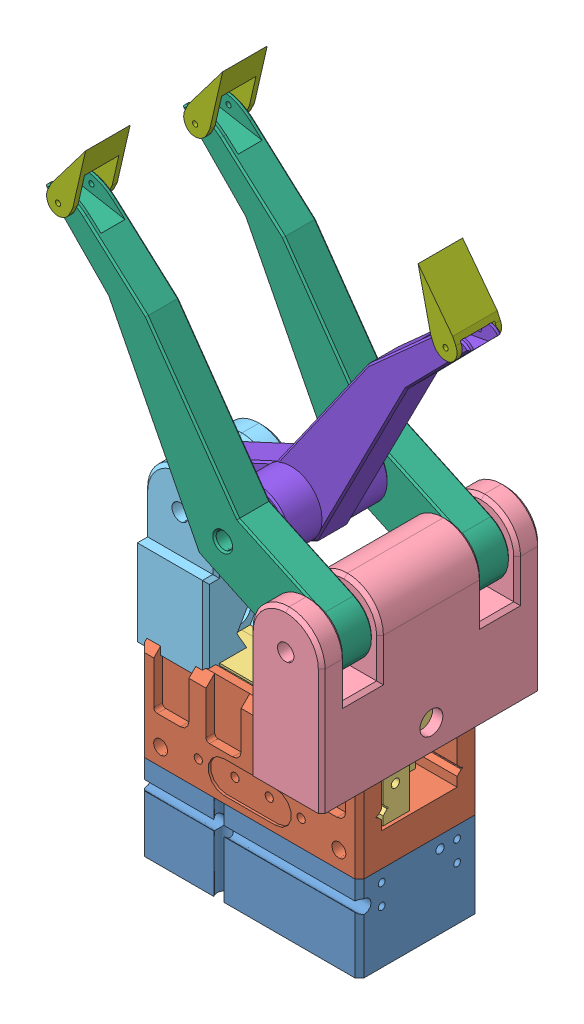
SolidWorks assembly scissor_draft5_assembly.SLDASM, configuration Default (file format 15000). Lengths in mm.
Overall size (143.11 180.65 64).
12 component instances, 8 part files, 32 mates.
Components (placement in the parent):
- SCHUNK-5518814 Gehaeuse MPG-plus 64-1: SCHUNK-5518814 Gehaeuse MPG-plus 64.sldprt [Default] at (0 25 0) x (1 0 0) z (0 0 -1) size (64.01 25 35.01)
- SCHUNK-5518813 Abdeckgehaeuse MPG-plus 64-1: SCHUNK-5518813 Abdeckgehaeuse MPG-plus 64.sldprt [Default] at (0 25 0) x (0 0 1) z (-1 0 0) size (35 29 64)
- SCHUNK-5518813 Finger MPG-plus 64-1: SCHUNK-5518813 Finger MPG-plus 64.sldprt [Default] at (-31.791 69.7 -0.75) x (-1 0 0) z (0 0 1) size (54 35.1 21.5)
- SCHUNK-5518813 Finger MPG-plus 64-2: SCHUNK-5518813 Finger MPG-plus 64.sldprt [Default] at (32 69.7 0.75) x (1 0 0) z (0 0 -1) size (54 35.1 21.5)
- scissor_attachment2_draft1-1: scissor_attachment2_draft1.SLDPRT [Default] at (15 76.2 0.5) x (-1 0 0) z (0 0 1) size (21 47 64)
- scissor_attachment_draft3-1: scissor_attachment_draft3.SLDPRT [Default] at (-14.791 76.2 0.5) x (1 0 0) z (0 0 -1) size (21 47 30)
- scissor1prong_draft5-1: scissor1prong_draft5.SLDPRT [Default] at (34.7304 61.9651 -19.25) x (-0.906981 0.42117 0) z (0 0 -1) size (111.71 51.45 9.55)
- scissor1prong_draft5-3: scissor1prong_draft5.SLDPRT [Default] at (34.7304 61.9651 20.75) x (-0.906981 0.42117 0) z (0 0 -1) size (111.71 51.45 9.55)
- scissor_tip_draft5-1: scissor_tip_draft5.SLDPRT [Default] at (-26.7675 157.5233 -19.5) x (0.906012 -0.423252 0) z (0 0 1) size (7.02 22.3 13)
- scissor_tip_draft5-2: scissor_tip_draft5.SLDPRT [Default] at (26.9765 157.5233 0.5) x (-0.906012 -0.423252 0) z (0 0 -1) size (7.02 22.3 13)
- scissor_tip_draft5-3: scissor_tip_draft5.SLDPRT [Default] at (-26.7675 157.5233 20.5) x (0.906012 -0.423252 0) z (0 0 1) size (7.02 22.3 13)
- scissor_middle_prong_draft5-1: scissor_middle_prong_draft5.SLDPRT [Default] at (-34.5214 61.9651 0.75) x (0.906981 0.42117 0) z (0 0 1) size (111.71 51.45 29.5)
Mates (geometry in assembly coordinates):
- Coincident2: coincident anti-aligned: plane of SCHUNK-5518814 Gehaeuse MPG-plus 64-1 through (-32 25 17.5) normal (0 1 0); plane of SCHUNK-5518813 Abdeckgehaeuse MPG-plus 64-1 through (32 25 -17.5) normal (0 -1 0)
- Coincident3: coincident aligned: plane of SCHUNK-5518814 Gehaeuse MPG-plus 64-1 through (-32 25 -16.2) normal (-1 0 0); plane of SCHUNK-5518813 Abdeckgehaeuse MPG-plus 64-1 through (-32 25 16.2) normal (-1 0 0)
- Coincident4: coincident aligned: plane of SCHUNK-5518814 Gehaeuse MPG-plus 64-1 through (30.7 25 -17.5) normal (0 0 -1); plane of SCHUNK-5518813 Abdeckgehaeuse MPG-plus 64-1 through (-30.7 25 -17.5) normal (0 0 -1)
- Distance4: distance = 1.4 mm anti-aligned: plane of SCHUNK-5518813 Abdeckgehaeuse MPG-plus 64-1 through (-32 40.17 -11) normal (0 0 1); plane of SCHUNK-5518813 Finger MPG-plus 64-1 through (21.209 47.13 -9.6) normal (0 0 -1)
- Distance5: distance = 3.9 mm anti-aligned: plane of SCHUNK-5518813 Finger MPG-plus 64-1 through (-30.791 51.4 -1.95) normal (0 0 1); plane of SCHUNK-5518813 Finger MPG-plus 64-2 through (31 51.4 1.95) normal (0 0 -1)
- Coincident10: coincident anti-aligned: plane of SCHUNK-5518813 Abdeckgehaeuse MPG-plus 64-1 through (32 34.6 -11) normal (0 1 0); plane of SCHUNK-5518813 Finger MPG-plus 64-1 through (21.209 34.6 -1.95) normal (0 -1 0)
- LimitDistance2: limit distance = 0.209 mm aligned: plane of SCHUNK-5518813 Finger MPG-plus 64-1 through (-31.791 69.7 -11.5) normal (-1 0 0); plane of SCHUNK-5518813 Abdeckgehaeuse MPG-plus 64-1 through (-32 25 16.2) normal (-1 0 0)
- LimitDistance3: limit distance aligned: plane of SCHUNK-5518813 Finger MPG-plus 64-2 through (32 69.7 11.5) normal (1 0 0); plane of SCHUNK-5518813 Abdeckgehaeuse MPG-plus 64-1 through (32 25 16.2) normal (1 0 0)
- Coincident15: coincident anti-aligned: plane of SCHUNK-5518813 Abdeckgehaeuse MPG-plus 64-1 through (32 34.6 -11) normal (0 1 0); plane of SCHUNK-5518813 Finger MPG-plus 64-2 through (-21 34.6 1.95) normal (0 -1 0)
- Coincident19: coincident anti-aligned: plane of SCHUNK-5518813 Finger MPG-plus 64-2 through (22 69.7 10) normal (0 1 0); plane of scissor_attachment2_draft1-1 through (15 69.7 0.5) normal (0 -1 0)
- Coincident20: coincident anti-aligned: plane of SCHUNK-5518813 Finger MPG-plus 64-2 through (22 69.7 -10) normal (0 0 -1); plane of scissor_attachment2_draft1-1 through (33 69.7 -10) normal (0 0 1)
- Coincident21: coincident anti-aligned: plane of SCHUNK-5518813 Finger MPG-plus 64-2 through (22 69.7 -10) normal (-1 0 0); plane of scissor_attachment2_draft1-1 through (22 69.7 -10) normal (1 0 0)
- Coincident27: coincident anti-aligned: plane of SCHUNK-5518813 Finger MPG-plus 64-1 through (-21.791 69.7 -10) normal (0 1 0); plane of scissor_attachment_draft3-1 through (-14.791 69.7 0.5) normal (0 -1 0)
- Coincident28: coincident anti-aligned: plane of SCHUNK-5518813 Finger MPG-plus 64-1 through (-21.791 69.7 -10) normal (0 0 -1); plane of scissor_attachment_draft3-1 through (-32.791 69.7 -10) normal (0 0 1)
- Coincident29: coincident anti-aligned: plane of SCHUNK-5518813 Finger MPG-plus 64-1 through (-21.791 69.7 10) normal (1 0 0); plane of scissor_attachment_draft3-1 through (-21.791 69.7 11) normal (-1 0 0)
- Concentric2: concentric aligned: cylinder of scissor_attachment2_draft1-1 through (25.5 87.2 -31.5) axis (0 0 1) radius 2.4; cylinder of scissor1prong_draft5-1 through (25.5 87.2 -24) axis (0 0 1) radius 2.4
- Coincident31: coincident anti-aligned: plane of scissor_attachment2_draft1-1 through (36 98.2 -14.5) normal (0 0 -1); plane of scissor1prong_draft5-1 through (34.7304 61.9651 -14.5) normal (0 0 1)
- Concentric3: concentric aligned: cylinder of scissor_attachment2_draft1-1 through (25.5 87.2 -31.5) axis (0 0 1) radius 2.4; cylinder of scissor1prong_draft5-3 through (25.5 87.2 16) axis (0 0 1) radius 2.4
- Coincident32: coincident anti-aligned: plane of scissor_attachment2_draft1-1 through (36 98.2 25.5) normal (0 0 -1); plane of scissor1prong_draft5-3 through (34.7304 61.9651 25.5) normal (0 0 1)
- Concentric6: concentric anti-aligned: cylinder of scissor1prong_draft5-3 through (-46.4364 161.9507 16) axis (0 0 1) radius 0.75; cylinder of scissor_tip_draft5-3 through (-46.4364 161.9507 27) axis (0 0 -1) radius 0.75
- Angle1: planar angle = 2.076942 rad anti-aligned: plane of scissor_tip_draft5-3 through (-42.1261 162.8835 27) normal (0.974728 -0.223395 0); plane of scissor1prong_draft5-3 through (-22.0784 144.7659 16) normal (0.667943 0.744212 0)
- Coincident38: coincident anti-aligned: plane of scissor1prong_draft5-3 through (34.7304 61.9651 25.5) normal (0 0 1); plane of scissor_tip_draft5-3 through (-26.7675 157.5233 25.5) normal (0 0 -1)
- Concentric8: concentric aligned: cylinder of scissor_attachment_draft3-1 through (-25.291 87.2 15.5) axis (0 0 -1) radius 2.4; cylinder of scissor_middle_prong_draft5-1 through (-25.291 87.2 5.5) axis (0 0 -1) radius 2.4
- Coincident41: coincident anti-aligned: plane of scissor_attachment_draft3-1 through (-35.791 98.2 5.5) normal (0 0 -1); plane of scissor_middle_prong_draft5-1 through (-34.5214 61.9651 5.5) normal (0 0 1)
- Concentric9: concentric anti-aligned: cylinder of scissor1prong_draft5-3 through (0.1045 98.9928 16) axis (0 0 1) radius 2.4; cylinder of scissor_middle_prong_draft5-1 through (0.1045 98.9928 5.5) axis (0 0 -1) radius 2.4
- Concentric10: concentric anti-aligned: cylinder of scissor1prong_draft5-1 through (0.1045 98.9928 -24) axis (0 0 1) radius 2.4; cylinder of scissor_middle_prong_draft5-1 through (0.1045 98.9928 5.5) axis (0 0 -1) radius 2.4
- Concentric11: concentric anti-aligned: cylinder of scissor_tip_draft5-2 through (46.6454 161.9507 -6) axis (0 0 1) radius 0.75; cylinder of scissor_middle_prong_draft5-1 through (46.6454 161.9507 5.5) axis (0 0 -1) radius 0.75
- Coincident42: coincident anti-aligned: plane of scissor_tip_draft5-2 through (26.9765 157.5233 5.5) normal (0 0 -1); plane of scissor_middle_prong_draft5-1 through (-34.5214 61.9651 5.5) normal (0 0 1)
- Angle2: planar angle = 2.076942 rad anti-aligned: plane of scissor_tip_draft5-2 through (42.3351 162.8835 -6) normal (-0.974728 -0.223395 0); plane of scissor_middle_prong_draft5-1 through (22.2874 144.7659 5.5) normal (-0.667943 0.744212 0)
- Concentric13: concentric anti-aligned: cylinder of scissor1prong_draft5-1 through (-46.4364 161.9507 -24) axis (0 0 1) radius 0.75; cylinder of scissor_tip_draft5-1 through (-46.4364 161.9507 -13) axis (0 0 -1) radius 0.75
- Coincident45: coincident anti-aligned: plane of scissor1prong_draft5-1 through (34.7304 61.9651 -14.5) normal (0 0 1); plane of scissor_tip_draft5-1 through (-26.7675 157.5233 -14.5) normal (0 0 -1)
- Angle3: planar angle = 4.206243 rad anti-aligned: plane of scissor_tip_draft5-1 through (-42.1261 162.8835 -13) normal (0.974728 -0.223395 0); plane of scissor1prong_draft5-1 through (-22.0784 144.7659 -24) normal (0.667943 0.744212 0)
